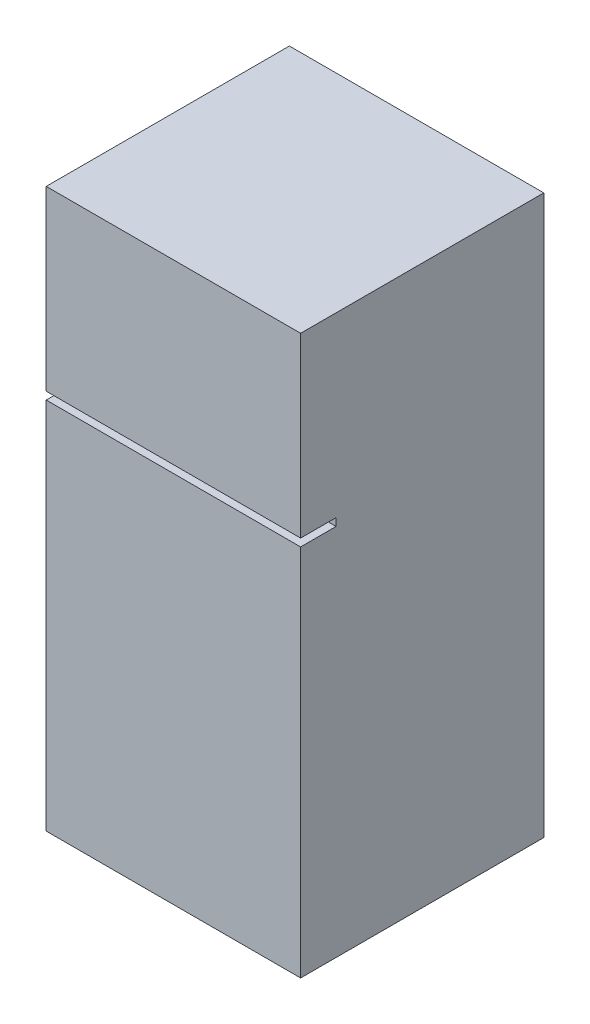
ISO-10303-21;
HEADER;
FILE_DESCRIPTION(('STEP AP214'),'2;1');
FILE_NAME('part.step','',(''),(''),'','','');
FILE_SCHEMA(('AUTOMOTIVE_DESIGN { 1 0 10303 214 1 1 1 1 }'));
ENDSEC;
DATA;
#1=APPLICATION_CONTEXT('core data for automotive mechanical design processes');
#2=APPLICATION_PROTOCOL_DEFINITION('international standard','automotive_design',2000,#1);
#3=PRODUCT_CONTEXT('',#1,'mechanical');
#4=PRODUCT('Part','Part','',(#3));
#5=PRODUCT_RELATED_PRODUCT_CATEGORY('part','',(#4));
#6=PRODUCT_DEFINITION_FORMATION('','',#4);
#7=PRODUCT_DEFINITION_CONTEXT('part definition',#1,'design');
#8=PRODUCT_DEFINITION('design','',#6,#7);
#9=PRODUCT_DEFINITION_SHAPE('','',#8);
#10=(LENGTH_UNIT() NAMED_UNIT(*) SI_UNIT(.MILLI.,.METRE.));
#11=(NAMED_UNIT(*) PLANE_ANGLE_UNIT() SI_UNIT($,.RADIAN.));
#12=(NAMED_UNIT(*) SI_UNIT($,.STERADIAN.) SOLID_ANGLE_UNIT());
#13=UNCERTAINTY_MEASURE_WITH_UNIT(LENGTH_MEASURE(1.E-05),#10,'distance_accuracy_value','');
#14=(GEOMETRIC_REPRESENTATION_CONTEXT(3) GLOBAL_UNCERTAINTY_ASSIGNED_CONTEXT((#13)) GLOBAL_UNIT_ASSIGNED_CONTEXT((#10,
#11,#12)) REPRESENTATION_CONTEXT('',''));
#15=CARTESIAN_POINT('',(0.,0.,0.));
#16=DIRECTION('',(0.,0.,1.));
#17=DIRECTION('',(1.,0.,0.));
#18=AXIS2_PLACEMENT_3D('',#15,#16,#17);
#19=CARTESIAN_POINT('',(0.,1574.8,0.));
#20=DIRECTION('',(0.,0.,-1.));
#21=DIRECTION('',(-1.,0.,0.));
#22=AXIS2_PLACEMENT_3D('',#19,#20,#21);
#23=PLANE('',#22);
#24=DIRECTION('',(0.,-1.,0.));
#25=VECTOR('',#24,1.);
#26=CARTESIAN_POINT('',(0.,1574.8,0.));
#27=LINE('',#26,#25);
#28=CARTESIAN_POINT('',(0.,1574.8,0.));
#29=VERTEX_POINT('',#28);
#30=CARTESIAN_POINT('',(0.,1074.46925359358,0.));
#31=VERTEX_POINT('',#30);
#32=EDGE_CURVE('E132',#29,#31,#27,.T.);
#33=ORIENTED_EDGE('',*,*,#32,.T.);
#34=DIRECTION('',(-1.,0.,0.));
#35=VECTOR('',#34,1.);
#36=CARTESIAN_POINT('',(-39.9854790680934,1074.46925359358,0.));
#37=LINE('',#36,#35);
#38=CARTESIAN_POINT('',(717.55,1074.46925359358,0.));
#39=VERTEX_POINT('',#38);
#40=EDGE_CURVE('E127',#39,#31,#37,.T.);
#41=ORIENTED_EDGE('',*,*,#40,.F.);
#42=DIRECTION('',(0.,-1.,0.));
#43=VECTOR('',#42,1.);
#44=CARTESIAN_POINT('',(717.55,1574.8,0.));
#45=LINE('',#44,#43);
#46=CARTESIAN_POINT('',(717.55,1574.8,0.));
#47=VERTEX_POINT('',#46);
#48=EDGE_CURVE('E133',#47,#39,#45,.T.);
#49=ORIENTED_EDGE('',*,*,#48,.F.);
#50=DIRECTION('',(1.,0.,0.));
#51=VECTOR('',#50,1.);
#52=CARTESIAN_POINT('',(0.,1574.8,0.));
#53=LINE('',#52,#51);
#54=EDGE_CURVE('E88',#29,#47,#53,.T.);
#55=ORIENTED_EDGE('',*,*,#54,.F.);
#56=EDGE_LOOP('',(#33,#41,#49,#55));
#57=FACE_BOUND('',#56,.T.);
#58=ADVANCED_FACE('F35',(#57),#23,.F.);
#59=CARTESIAN_POINT('',(0.,1574.8,0.));
#60=DIRECTION('',(1.,0.,0.));
#61=DIRECTION('',(0.,0.,-1.));
#62=AXIS2_PLACEMENT_3D('',#59,#60,#61);
#63=PLANE('',#62);
#64=DIRECTION('',(0.,-1.,0.));
#65=VECTOR('',#64,1.);
#66=CARTESIAN_POINT('',(0.,1574.8,-100.));
#67=LINE('',#66,#65);
#68=CARTESIAN_POINT('',(0.,1074.46925359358,-100.));
#69=VERTEX_POINT('',#68);
#70=CARTESIAN_POINT('',(0.,1052.93798111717,-100.));
#71=VERTEX_POINT('',#70);
#72=EDGE_CURVE('E118',#69,#71,#67,.T.);
#73=ORIENTED_EDGE('',*,*,#72,.F.);
#74=DIRECTION('',(0.,0.,1.));
#75=VECTOR('',#74,1.);
#76=CARTESIAN_POINT('',(0.,1074.46925359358,0.));
#77=LINE('',#76,#75);
#78=EDGE_CURVE('E117',#69,#31,#77,.T.);
#79=ORIENTED_EDGE('',*,*,#78,.T.);
#80=ORIENTED_EDGE('',*,*,#32,.F.);
#81=DIRECTION('',(0.,0.,1.));
#82=VECTOR('',#81,1.);
#83=CARTESIAN_POINT('',(0.,1574.8,0.));
#84=LINE('',#83,#82);
#85=CARTESIAN_POINT('',(0.,1574.8,-685.8));
#86=VERTEX_POINT('',#85);
#87=EDGE_CURVE('E157',#86,#29,#84,.T.);
#88=ORIENTED_EDGE('',*,*,#87,.F.);
#89=DIRECTION('',(0.,-1.,0.));
#90=VECTOR('',#89,1.);
#91=CARTESIAN_POINT('',(0.,1574.8,-685.8));
#92=LINE('',#91,#90);
#93=CARTESIAN_POINT('',(0.,0.,-685.8));
#94=VERTEX_POINT('',#93);
#95=EDGE_CURVE('E163',#86,#94,#92,.T.);
#96=ORIENTED_EDGE('',*,*,#95,.T.);
#97=DIRECTION('',(0.,0.,1.));
#98=VECTOR('',#97,1.);
#99=CARTESIAN_POINT('',(0.,0.,0.));
#100=LINE('',#99,#98);
#101=CARTESIAN_POINT('',(0.,0.,0.));
#102=VERTEX_POINT('',#101);
#103=EDGE_CURVE('E131',#94,#102,#100,.T.);
#104=ORIENTED_EDGE('',*,*,#103,.T.);
#105=CARTESIAN_POINT('',(0.,1052.93798111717,0.));
#106=VERTEX_POINT('',#105);
#107=EDGE_CURVE('E124',#106,#102,#27,.T.);
#108=ORIENTED_EDGE('',*,*,#107,.F.);
#109=DIRECTION('',(0.,0.,-1.));
#110=VECTOR('',#109,1.);
#111=CARTESIAN_POINT('',(0.,1052.93798111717,0.));
#112=LINE('',#111,#110);
#113=EDGE_CURVE('E109',#106,#71,#112,.T.);
#114=ORIENTED_EDGE('',*,*,#113,.T.);
#115=EDGE_LOOP('',(#73,#79,#80,#88,#96,#104,#108,#114));
#116=FACE_BOUND('',#115,.T.);
#117=ADVANCED_FACE('F37',(#116),#63,.F.);
#118=CARTESIAN_POINT('',(717.55,1052.93798111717,0.));
#119=VERTEX_POINT('',#118);
#120=CARTESIAN_POINT('',(717.55,0.,0.));
#121=VERTEX_POINT('',#120);
#122=EDGE_CURVE('E126',#119,#121,#45,.T.);
#123=ORIENTED_EDGE('',*,*,#122,.F.);
#124=DIRECTION('',(1.,0.,0.));
#125=VECTOR('',#124,1.);
#126=CARTESIAN_POINT('',(-39.9854790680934,1052.93798111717,0.));
#127=LINE('',#126,#125);
#128=EDGE_CURVE('E112',#106,#119,#127,.T.);
#129=ORIENTED_EDGE('',*,*,#128,.F.);
#130=ORIENTED_EDGE('',*,*,#107,.T.);
#131=DIRECTION('',(1.,0.,0.));
#132=VECTOR('',#131,1.);
#133=CARTESIAN_POINT('',(0.,0.,0.));
#134=LINE('',#133,#132);
#135=EDGE_CURVE('E165',#102,#121,#134,.T.);
#136=ORIENTED_EDGE('',*,*,#135,.T.);
#137=EDGE_LOOP('',(#123,#129,#130,#136));
#138=FACE_BOUND('',#137,.T.);
#139=ADVANCED_FACE('F122',(#138),#23,.F.);
#140=CARTESIAN_POINT('',(717.55,1574.8,0.));
#141=DIRECTION('',(-1.,0.,0.));
#142=DIRECTION('',(0.,0.,1.));
#143=AXIS2_PLACEMENT_3D('',#140,#141,#142);
#144=PLANE('',#143);
#145=ORIENTED_EDGE('',*,*,#48,.T.);
#146=DIRECTION('',(0.,0.,-1.));
#147=VECTOR('',#146,1.);
#148=CARTESIAN_POINT('',(717.55,1074.46925359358,0.));
#149=LINE('',#148,#147);
#150=CARTESIAN_POINT('',(717.55,1074.46925359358,-100.));
#151=VERTEX_POINT('',#150);
#152=EDGE_CURVE('E11',#39,#151,#149,.T.);
#153=ORIENTED_EDGE('',*,*,#152,.T.);
#154=DIRECTION('',(0.,1.,0.));
#155=VECTOR('',#154,1.);
#156=CARTESIAN_POINT('',(717.55,1574.8,-100.));
#157=LINE('',#156,#155);
#158=CARTESIAN_POINT('',(717.55,1052.93798111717,-100.));
#159=VERTEX_POINT('',#158);
#160=EDGE_CURVE('E135',#159,#151,#157,.T.);
#161=ORIENTED_EDGE('',*,*,#160,.F.);
#162=DIRECTION('',(0.,0.,1.));
#163=VECTOR('',#162,1.);
#164=CARTESIAN_POINT('',(717.55,1052.93798111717,0.));
#165=LINE('',#164,#163);
#166=EDGE_CURVE('E43',#159,#119,#165,.T.);
#167=ORIENTED_EDGE('',*,*,#166,.T.);
#168=ORIENTED_EDGE('',*,*,#122,.T.);
#169=DIRECTION('',(0.,0.,-1.));
#170=VECTOR('',#169,1.);
#171=CARTESIAN_POINT('',(717.55,0.,0.));
#172=LINE('',#171,#170);
#173=CARTESIAN_POINT('',(717.55,0.,-685.8));
#174=VERTEX_POINT('',#173);
#175=EDGE_CURVE('E167',#121,#174,#172,.T.);
#176=ORIENTED_EDGE('',*,*,#175,.T.);
#177=DIRECTION('',(0.,-1.,0.));
#178=VECTOR('',#177,1.);
#179=CARTESIAN_POINT('',(717.55,1574.8,-685.8));
#180=LINE('',#179,#178);
#181=CARTESIAN_POINT('',(717.55,1574.8,-685.8));
#182=VERTEX_POINT('',#181);
#183=EDGE_CURVE('E170',#182,#174,#180,.T.);
#184=ORIENTED_EDGE('',*,*,#183,.F.);
#185=DIRECTION('',(0.,0.,-1.));
#186=VECTOR('',#185,1.);
#187=CARTESIAN_POINT('',(717.55,1574.8,0.));
#188=LINE('',#187,#186);
#189=EDGE_CURVE('E160',#47,#182,#188,.T.);
#190=ORIENTED_EDGE('',*,*,#189,.F.);
#191=EDGE_LOOP('',(#145,#153,#161,#167,#168,#176,#184,#190));
#192=FACE_BOUND('',#191,.T.);
#193=ADVANCED_FACE('F142',(#192),#144,.F.);
#194=CARTESIAN_POINT('',(0.,1574.8,-685.8));
#195=DIRECTION('',(0.,0.,1.));
#196=DIRECTION('',(1.,0.,0.));
#197=AXIS2_PLACEMENT_3D('',#194,#195,#196);
#198=PLANE('',#197);
#199=DIRECTION('',(-1.,0.,0.));
#200=VECTOR('',#199,1.);
#201=CARTESIAN_POINT('',(0.,0.,-685.8));
#202=LINE('',#201,#200);
#203=EDGE_CURVE('E80',#174,#94,#202,.T.);
#204=ORIENTED_EDGE('',*,*,#203,.T.);
#205=ORIENTED_EDGE('',*,*,#95,.F.);
#206=DIRECTION('',(-1.,0.,0.));
#207=VECTOR('',#206,1.);
#208=CARTESIAN_POINT('',(0.,1574.8,-685.8));
#209=LINE('',#208,#207);
#210=EDGE_CURVE('E59',#182,#86,#209,.T.);
#211=ORIENTED_EDGE('',*,*,#210,.F.);
#212=ORIENTED_EDGE('',*,*,#183,.T.);
#213=EDGE_LOOP('',(#204,#205,#211,#212));
#214=FACE_BOUND('',#213,.T.);
#215=ADVANCED_FACE('F172',(#214),#198,.F.);
#216=CARTESIAN_POINT('',(0.,1574.8,-685.8));
#217=DIRECTION('',(0.,-1.,0.));
#218=DIRECTION('',(0.,0.,-1.));
#219=AXIS2_PLACEMENT_3D('',#216,#217,#218);
#220=PLANE('',#219);
#221=ORIENTED_EDGE('',*,*,#87,.T.);
#222=ORIENTED_EDGE('',*,*,#54,.T.);
#223=ORIENTED_EDGE('',*,*,#189,.T.);
#224=ORIENTED_EDGE('',*,*,#210,.T.);
#225=EDGE_LOOP('',(#221,#222,#223,#224));
#226=FACE_BOUND('',#225,.T.);
#227=ADVANCED_FACE('F178',(#226),#220,.F.);
#228=CARTESIAN_POINT('',(0.,0.,-685.8));
#229=DIRECTION('',(0.,-1.,0.));
#230=DIRECTION('',(0.,0.,-1.));
#231=AXIS2_PLACEMENT_3D('',#228,#229,#230);
#232=PLANE('',#231);
#233=ORIENTED_EDGE('',*,*,#103,.F.);
#234=ORIENTED_EDGE('',*,*,#203,.F.);
#235=ORIENTED_EDGE('',*,*,#175,.F.);
#236=ORIENTED_EDGE('',*,*,#135,.F.);
#237=EDGE_LOOP('',(#233,#234,#235,#236));
#238=FACE_BOUND('',#237,.T.);
#239=ADVANCED_FACE('F176',(#238),#232,.T.);
#240=CARTESIAN_POINT('',(-39.9854790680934,1074.46925359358,-100.));
#241=DIRECTION('',(0.,1.,0.));
#242=DIRECTION('',(0.,0.,1.));
#243=AXIS2_PLACEMENT_3D('',#240,#241,#242);
#244=PLANE('',#243);
#245=DIRECTION('',(-1.,0.,0.));
#246=VECTOR('',#245,1.);
#247=CARTESIAN_POINT('',(-39.9854790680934,1074.46925359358,-100.));
#248=LINE('',#247,#246);
#249=EDGE_CURVE('E146',#151,#69,#248,.T.);
#250=ORIENTED_EDGE('',*,*,#249,.F.);
#251=ORIENTED_EDGE('',*,*,#152,.F.);
#252=ORIENTED_EDGE('',*,*,#40,.T.);
#253=ORIENTED_EDGE('',*,*,#78,.F.);
#254=EDGE_LOOP('',(#250,#251,#252,#253));
#255=FACE_BOUND('',#254,.T.);
#256=ADVANCED_FACE('F148',(#255),#244,.F.);
#257=CARTESIAN_POINT('',(-39.9854790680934,1052.93798111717,-100.));
#258=DIRECTION('',(0.,-1.,0.));
#259=DIRECTION('',(0.,0.,-1.));
#260=AXIS2_PLACEMENT_3D('',#257,#258,#259);
#261=PLANE('',#260);
#262=ORIENTED_EDGE('',*,*,#128,.T.);
#263=ORIENTED_EDGE('',*,*,#166,.F.);
#264=DIRECTION('',(1.,0.,0.));
#265=VECTOR('',#264,1.);
#266=CARTESIAN_POINT('',(-39.9854790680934,1052.93798111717,-100.));
#267=LINE('',#266,#265);
#268=EDGE_CURVE('E50',#71,#159,#267,.T.);
#269=ORIENTED_EDGE('',*,*,#268,.F.);
#270=ORIENTED_EDGE('',*,*,#113,.F.);
#271=EDGE_LOOP('',(#262,#263,#269,#270));
#272=FACE_BOUND('',#271,.T.);
#273=ADVANCED_FACE('F111',(#272),#261,.F.);
#274=CARTESIAN_POINT('',(-39.9854790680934,1052.93798111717,-100.));
#275=DIRECTION('',(0.,0.,1.));
#276=DIRECTION('',(1.,0.,0.));
#277=AXIS2_PLACEMENT_3D('',#274,#275,#276);
#278=PLANE('',#277);
#279=ORIENTED_EDGE('',*,*,#72,.T.);
#280=ORIENTED_EDGE('',*,*,#268,.T.);
#281=ORIENTED_EDGE('',*,*,#160,.T.);
#282=ORIENTED_EDGE('',*,*,#249,.T.);
#283=EDGE_LOOP('',(#279,#280,#281,#282));
#284=FACE_BOUND('',#283,.T.);
#285=ADVANCED_FACE('F145',(#284),#278,.T.);
#286=CLOSED_SHELL('',(#58,#117,#139,#193,#215,#227,#239,#256,#273,#285));
#287=MANIFOLD_SOLID_BREP('B2',#286);
#288=ADVANCED_BREP_SHAPE_REPRESENTATION('',(#18,#287),#14);
#289=SHAPE_DEFINITION_REPRESENTATION(#9,#288);
ENDSEC;
END-ISO-10303-21;
